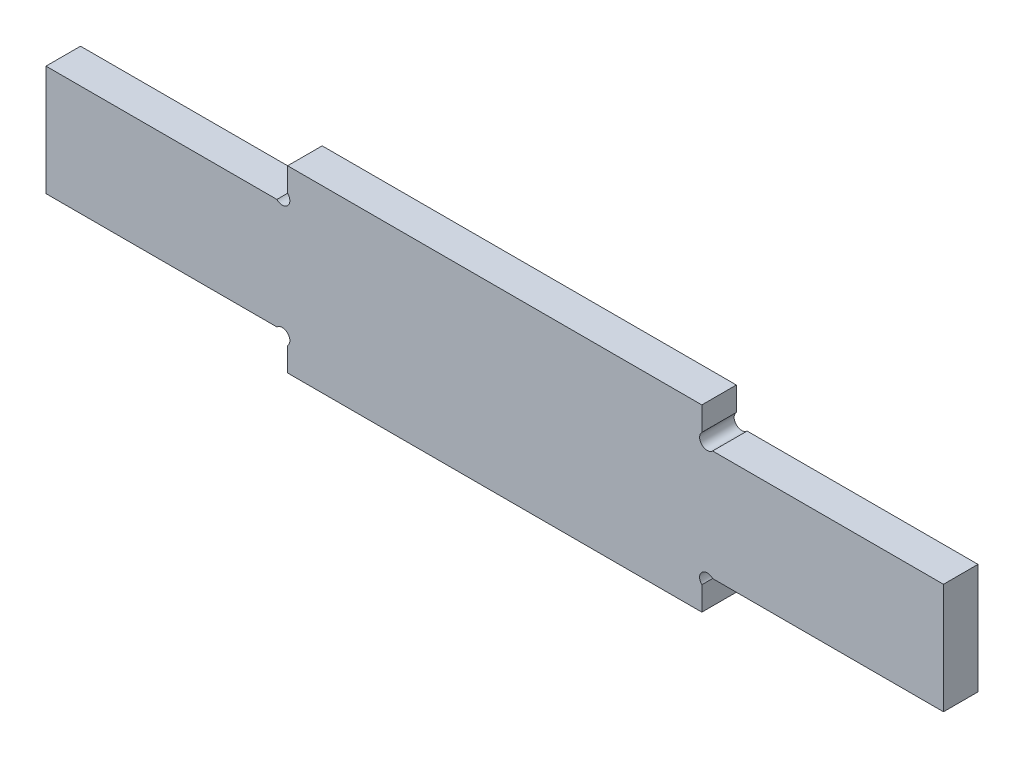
from build123d import *

# Parameters (mm, degrees)
ESQUISSE1_W             = 65
ESQUISSE1_H             = 26
BOSS_EXTRU_1_DEPTH      = 5
ENL_V_MAT_EXTRU_1_REACH = 72.185
ESQUISSE2_W             = 35
ESQUISSE2_H             = 5
ENL_V_START             = -5
ESQUISSE3_R             = 1.1
ENL_V_MAT_EXTRU_2_DEPTH = 5


with BuildPart() as part:
    # Esquisse1 → Boss.-Extru.1 (new body)
    with BuildSketch(Plane.XY):
        with Locations((32.5, 13)):
            Rectangle(ESQUISSE1_W, ESQUISSE1_H)
    boss_extru_1 = extrude(amount=BOSS_EXTRU_1_DEPTH)

    # Esquisse2 → Enl_v. mat.-Extru.1 (cut, up to next)
    with BuildSketch(Plane.XY.offset(5), mode=Mode.PRIVATE) as enl_v_mat_extru_1_sk1:
        with Locations((17.5, 23.5)):
            Rectangle(ESQUISSE2_W, ESQUISSE2_H)
    enl_v_mat_extru_1_tool1 = extrude(enl_v_mat_extru_1_sk1.sketch, amount=-ENL_V_MAT_EXTRU_1_REACH, mode=Mode.PRIVATE) & part.part
    # Esquisse2 → Enl_v. mat.-Extru.1 (cut, up to next)
    with BuildSketch(Plane.XY.offset(5), mode=Mode.PRIVATE) as enl_v_mat_extru_1_sk2:
        with Locations((17.5, 2.5)):
            Rectangle(ESQUISSE2_W, ESQUISSE2_H)
    enl_v_mat_extru_1_tool2 = extrude(enl_v_mat_extru_1_sk2.sketch, amount=-ENL_V_MAT_EXTRU_1_REACH, mode=Mode.PRIVATE) & part.part
    enl_v_mat_extru_1_1 = enl_v_mat_extru_1_tool1.solids().sort_by_distance((17.5, 23.5, 5))[0]
    add(enl_v_mat_extru_1_1, mode=Mode.SUBTRACT)
    enl_v_mat_extru_1_2 = enl_v_mat_extru_1_tool2.solids().sort_by_distance((17.5, 2.5, 5))[0]
    add(enl_v_mat_extru_1_2, mode=Mode.SUBTRACT)
    enl_v_mat_extru_1 = enl_v_mat_extru_1_1 + enl_v_mat_extru_1_2  # Enl_v. mat.-Extru.1 as one shape, for the pattern or mirror that repeats it

    # Esquisse3 → Enl_v. mat.-Extru.2 (cut)
    with BuildSketch(Plane.XY.offset(5).offset(ENL_V_START)):
        with Locations((34.222182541, 21.777817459)):
            Circle(ESQUISSE3_R)
        with Locations((34.222182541, 4.222182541)):
            Circle(ESQUISSE3_R)
    enl_v_mat_extru_2 = extrude(amount=ENL_V_MAT_EXTRU_2_DEPTH, mode=Mode.SUBTRACT)

    # Sym_trie1: Boss.-Extru.1, Enl_v. mat.-Extru.1, Enl_v. mat.-Extru.2 across plane
    add(boss_extru_1.mirror(Plane(origin=(65, 0, 5), x_dir=(0, 0, 1), z_dir=(-1, 0, 0))))
    add(enl_v_mat_extru_1.mirror(Plane(origin=(65, 0, 5), x_dir=(0, 0, 1), z_dir=(-1, 0, 0))), mode=Mode.SUBTRACT)
    add(enl_v_mat_extru_2.mirror(Plane(origin=(65, 0, 5), x_dir=(0, 0, 1), z_dir=(-1, 0, 0))), mode=Mode.SUBTRACT)


solid = part.part
